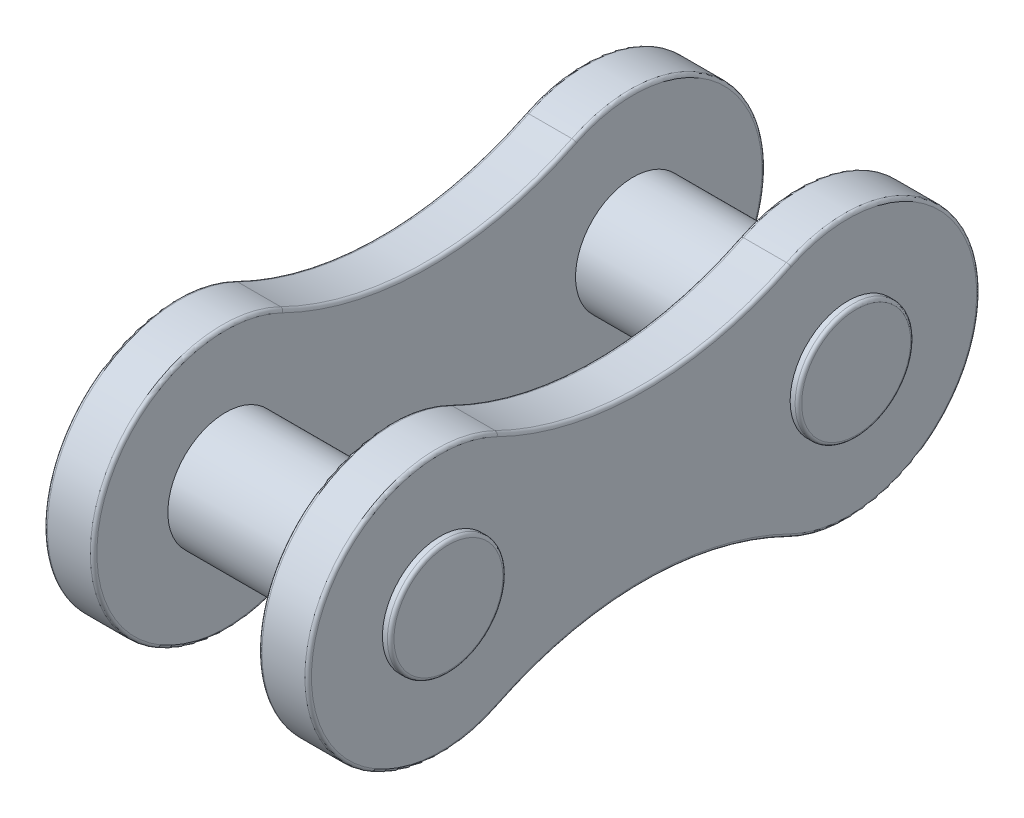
from build123d import *

# Parameters (mm, degrees)
BOSS_EXTRUDE1_START = 2.5
SKETCH1_R           = 1.75
BOSS_EXTRUDE1_DEPTH = 1.5
BOSS_EXTRUDE2_START = -2.5
SKETCH2_R           = 1.75
BOSS_EXTRUDE2_DEPTH = 1.5
SKETCH3_R           = 1.75
BOSS_EXTRUDE3_DEPTH = 4.25
FILLET1_R           = 0.1


with BuildPart() as part:
    # Sketch1 → Boss-Extrude1 (new body)
    with BuildSketch(Plane(origin=(0, 0, 0), x_dir=(0, 0, -1), z_dir=(1, 0, 0)).offset(BOSS_EXTRUDE1_START)):
        with BuildLine():
            ThreePointArc((-4.410714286, 3.589888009), (-10.175, 0), (-4.410714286, -3.589888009))
            ThreePointArc((-4.410714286, -3.589888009), (0, -2.564608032), (4.410714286, -3.589888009))
            ThreePointArc((4.410714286, -3.589888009), (10.175, 0), (4.410714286, 3.589888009))
            ThreePointArc((4.410714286, 3.589888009), (0, 2.564608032), (-4.410714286, 3.589888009))
        make_face()
        with Locations((-6.175, 0)):
            Circle(SKETCH1_R, mode=Mode.SUBTRACT)
        with Locations(Location((6.175, 0, 0), (0, 0, 180))):
            Circle(SKETCH1_R, mode=Mode.SUBTRACT)
    extrude(amount=BOSS_EXTRUDE1_DEPTH)



with BuildPart() as body_2:
    # Sketch2 → Boss-Extrude2 (new body)
    with BuildSketch(Plane(origin=(0, 0, 0), x_dir=(0, 0, -1), z_dir=(1, 0, 0)).offset(BOSS_EXTRUDE2_START)):
        with BuildLine():
            ThreePointArc((4.410714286, -3.589888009), (0, -2.564608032), (-4.410714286, -3.589888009))
            ThreePointArc((-4.410714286, -3.589888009), (-10.175, 0), (-4.410714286, 3.589888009))
            ThreePointArc((-4.410714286, 3.589888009), (0, 2.564608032), (4.410714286, 3.589888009))
            ThreePointArc((4.410714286, 3.589888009), (10.175, 0), (4.410714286, -3.589888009))
        make_face()
        with Locations(Location((6.175, 0, 0), (0, 0, 180))):
            Circle(SKETCH2_R, mode=Mode.SUBTRACT)
        with Locations((-6.175, 0)):
            Circle(SKETCH2_R, mode=Mode.SUBTRACT)
    extrude(amount=-BOSS_EXTRUDE2_DEPTH)


with BuildPart() as part_1:
    add(part.part)

    add(body_2.part)  # Boss-Extrude3 merges body 2
    # Sketch3 → Boss-Extrude3 (add, symmetric)
    with BuildSketch(Plane(origin=(0, 0, 0), x_dir=(0, 0, -1), z_dir=(1, 0, 0))):
        with Locations((6.175, 0)):
            Circle(SKETCH3_R)
        with Locations((-6.175, 0)):
            Circle(SKETCH3_R)
    extrude(amount=BOSS_EXTRUDE3_DEPTH, both=True)

    # Fillet1
    fillet1_edges = [part_1.edges().sort_by_distance(p)[0] for p in [
        (4, -2.564608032, 0),
        (4, 0, -10.175),
        (4.25, 0, -4.425),
        (-4, 0, -10.175),
        (-4, -2.564608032, 0),
        (-4, 0, 10.175),
        (-4, 2.564608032, 0),
        (-2.5, 0, -10.175),
        (-2.5, 2.564608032, 0),
        (-2.5, 0, 10.175),
        (-2.5, -2.564608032, 0),
        (-4.25, 0, 7.925),
        (4.25, 0, 7.925),
        (4, 2.564608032, 0),
        (2.5, 0, -10.175),
        (2.5, -2.564608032, 0),
        (2.5, 0, 10.175),
        (2.5, 2.564608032, 0),
        (4, 0, 10.175),
    ]]
    fillet(fillet1_edges, radius=FILLET1_R)


solid = part_1.part
